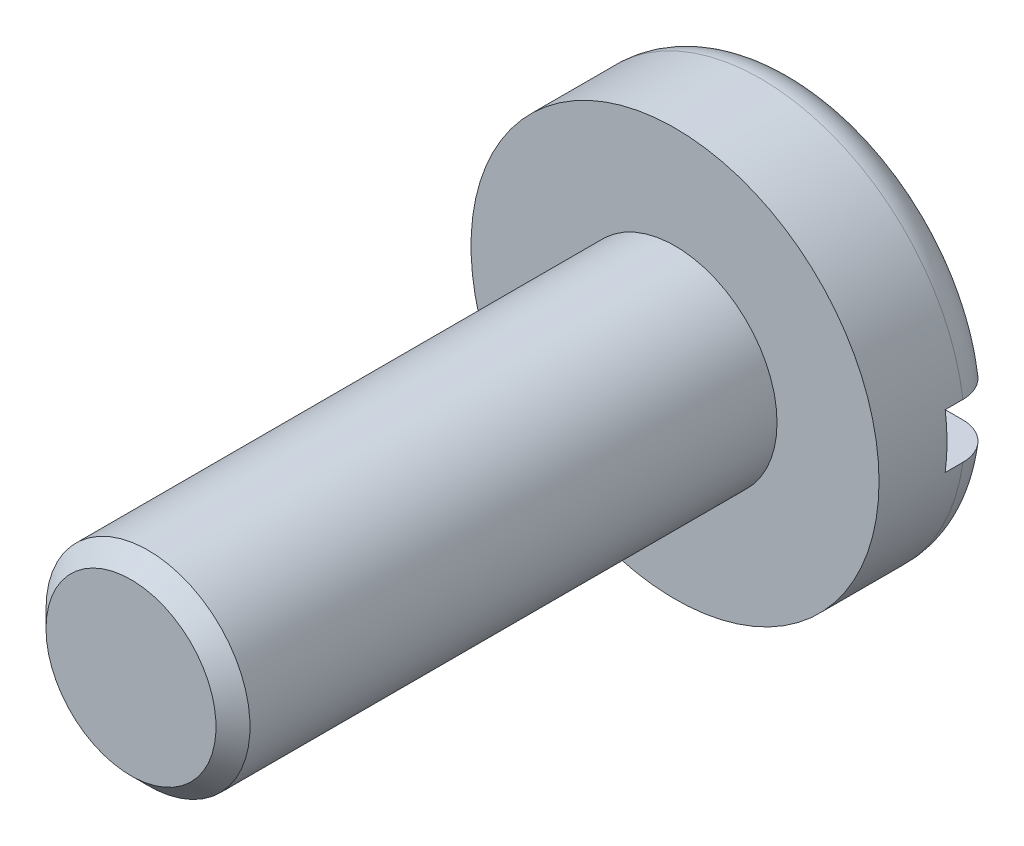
ISO-10303-21;
HEADER;
FILE_DESCRIPTION(('STEP AP214'),'2;1');
FILE_NAME('part.step','',(''),(''),'','','');
FILE_SCHEMA(('AUTOMOTIVE_DESIGN { 1 0 10303 214 1 1 1 1 }'));
ENDSEC;
DATA;
#1=APPLICATION_CONTEXT('core data for automotive mechanical design processes');
#2=APPLICATION_PROTOCOL_DEFINITION('international standard','automotive_design',2000,#1);
#3=PRODUCT_CONTEXT('',#1,'mechanical');
#4=PRODUCT('Part','Part','',(#3));
#5=PRODUCT_RELATED_PRODUCT_CATEGORY('part','',(#4));
#6=PRODUCT_DEFINITION_FORMATION('','',#4);
#7=PRODUCT_DEFINITION_CONTEXT('part definition',#1,'design');
#8=PRODUCT_DEFINITION('design','',#6,#7);
#9=PRODUCT_DEFINITION_SHAPE('','',#8);
#10=(LENGTH_UNIT() NAMED_UNIT(*) SI_UNIT(.MILLI.,.METRE.));
#11=(NAMED_UNIT(*) PLANE_ANGLE_UNIT() SI_UNIT($,.RADIAN.));
#12=(NAMED_UNIT(*) SI_UNIT($,.STERADIAN.) SOLID_ANGLE_UNIT());
#13=UNCERTAINTY_MEASURE_WITH_UNIT(LENGTH_MEASURE(1.E-05),#10,'distance_accuracy_value','');
#14=(GEOMETRIC_REPRESENTATION_CONTEXT(3) GLOBAL_UNCERTAINTY_ASSIGNED_CONTEXT((#13)) GLOBAL_UNIT_ASSIGNED_CONTEXT((#10,
#11,#12)) REPRESENTATION_CONTEXT('',''));
#15=CARTESIAN_POINT('',(0.,0.,0.));
#16=DIRECTION('',(0.,0.,1.));
#17=DIRECTION('',(1.,0.,0.));
#18=AXIS2_PLACEMENT_3D('',#15,#16,#17);
#19=CARTESIAN_POINT('',(0.,0.,3.6));
#20=DIRECTION('',(0.,0.,1.));
#21=DIRECTION('',(1.,0.,0.));
#22=AXIS2_PLACEMENT_3D('',#19,#20,#21);
#23=PLANE('',#22);
#24=CARTESIAN_POINT('',(0.,0.,3.6));
#25=DIRECTION('',(0.,0.,1.));
#26=DIRECTION('',(1.,0.,0.));
#27=AXIS2_PLACEMENT_3D('',#24,#25,#26);
#28=CIRCLE('',#27,6.);
#29=CARTESIAN_POINT('',(6.,0.,3.6));
#30=VERTEX_POINT('',#29);
#31=EDGE_CURVE('E150',#30,#30,#28,.T.);
#32=ORIENTED_EDGE('',*,*,#31,.T.);
#33=EDGE_LOOP('',(#32));
#34=FACE_BOUND('',#33,.T.);
#35=CARTESIAN_POINT('',(0.,0.,3.6));
#36=DIRECTION('',(0.,0.,1.));
#37=DIRECTION('',(1.,0.,0.));
#38=AXIS2_PLACEMENT_3D('',#35,#36,#37);
#39=CIRCLE('',#38,3.);
#40=CARTESIAN_POINT('',(3.,0.,3.6));
#41=VERTEX_POINT('',#40);
#42=EDGE_CURVE('E160',#41,#41,#39,.T.);
#43=ORIENTED_EDGE('',*,*,#42,.F.);
#44=EDGE_LOOP('',(#43));
#45=FACE_BOUND('',#44,.T.);
#46=ADVANCED_FACE('F33',(#34,#45),#23,.T.);
#47=CARTESIAN_POINT('',(0.,0.,0.));
#48=DIRECTION('',(0.,0.,1.));
#49=DIRECTION('',(1.,0.,0.));
#50=AXIS2_PLACEMENT_3D('',#47,#48,#49);
#51=PLANE('',#50);
#52=CARTESIAN_POINT('',(0.,0.,0.));
#53=DIRECTION('',(0.,0.,1.));
#54=DIRECTION('',(1.,0.,0.));
#55=AXIS2_PLACEMENT_3D('',#52,#53,#54);
#56=CIRCLE('',#55,4.92);
#57=CARTESIAN_POINT('',(-4.85452366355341,0.8,0.));
#58=VERTEX_POINT('',#57);
#59=CARTESIAN_POINT('',(4.85452366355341,0.8,0.));
#60=VERTEX_POINT('',#59);
#61=EDGE_CURVE('E107',#58,#60,#56,.F.);
#62=ORIENTED_EDGE('',*,*,#61,.T.);
#63=DIRECTION('',(1.,0.,0.));
#64=VECTOR('',#63,1.);
#65=CARTESIAN_POINT('',(-6.,0.800000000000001,0.));
#66=LINE('',#65,#64);
#67=EDGE_CURVE('E96',#58,#60,#66,.T.);
#68=ORIENTED_EDGE('',*,*,#67,.F.);
#69=EDGE_LOOP('',(#62,#68));
#70=FACE_BOUND('',#69,.T.);
#71=ADVANCED_FACE('F135',(#70),#51,.F.);
#72=CARTESIAN_POINT('',(0.,0.,1.08));
#73=DIRECTION('',(0.,0.,1.));
#74=DIRECTION('',(1.,0.,0.));
#75=AXIS2_PLACEMENT_3D('',#72,#73,#74);
#76=TOROIDAL_SURFACE('',#75,4.92,1.08);
#77=CARTESIAN_POINT('',(-5.60321799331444,0.8,0.293399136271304));
#78=CARTESIAN_POINT('',(-5.55825247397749,0.8,0.251523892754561));
#79=CARTESIAN_POINT('',(-5.50968619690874,0.8,0.213444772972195));
#80=CARTESIAN_POINT('',(-5.40679293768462,0.8,0.145975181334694));
#81=CARTESIAN_POINT('',(-5.35245837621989,0.800000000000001,0.116596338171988));
#82=CARTESIAN_POINT('',(-5.23968603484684,0.800000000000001,0.0673772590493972));
#83=CARTESIAN_POINT('',(-5.18125217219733,0.800000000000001,0.0475280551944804));
#84=CARTESIAN_POINT('',(-5.06191469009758,0.800000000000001,0.0178417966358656));
#85=CARTESIAN_POINT('',(-5.00101168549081,0.800000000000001,0.00800226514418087));
#86=CARTESIAN_POINT('',(-4.87792616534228,0.800000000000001,-0.00148497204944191));
#87=CARTESIAN_POINT('',(-4.81573730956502,0.800000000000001,-0.00105044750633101));
#88=CARTESIAN_POINT('',(-4.69229686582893,0.800000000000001,0.0101706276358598));
#89=CARTESIAN_POINT('',(-4.63104536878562,0.800000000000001,0.0209581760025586));
#90=CARTESIAN_POINT('',(-4.51074724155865,0.800000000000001,0.0526950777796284));
#91=CARTESIAN_POINT('',(-4.45172024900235,0.800000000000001,0.0737189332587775));
#92=CARTESIAN_POINT('',(-4.33803453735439,0.800000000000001,0.125385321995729));
#93=CARTESIAN_POINT('',(-4.28337589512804,0.8,0.15602802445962));
#94=CARTESIAN_POINT('',(-4.18006433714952,0.8,0.226070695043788));
#95=CARTESIAN_POINT('',(-4.13140566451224,0.8,0.265462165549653));
#96=CARTESIAN_POINT('',(-4.0414936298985,0.8,0.351948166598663));
#97=CARTESIAN_POINT('',(-4.0002398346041,0.8,0.399042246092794));
#98=CARTESIAN_POINT('',(-3.92689138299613,0.8,0.498992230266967));
#99=CARTESIAN_POINT('',(-3.89468909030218,0.8,0.551769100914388));
#100=CARTESIAN_POINT('',(-3.83980909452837,0.8,0.662062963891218));
#101=CARTESIAN_POINT('',(-3.81713019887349,0.8,0.719579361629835));
#102=CARTESIAN_POINT('',(-3.78240723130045,0.8,0.836503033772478));
#103=CARTESIAN_POINT('',(-3.77016237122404,0.8,0.895850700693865));
#104=CARTESIAN_POINT('',(-3.75597196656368,0.8,1.01576297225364));
#105=CARTESIAN_POINT('',(-3.75402537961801,0.8,1.07632745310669));
#106=CARTESIAN_POINT('',(-3.76044900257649,0.8,1.1960335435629));
#107=CARTESIAN_POINT('',(-3.76867210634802,0.8,1.25518311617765));
#108=CARTESIAN_POINT('',(-3.79491365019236,0.8,1.37126517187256));
#109=CARTESIAN_POINT('',(-3.81293207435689,0.8,1.42819765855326));
#110=CARTESIAN_POINT('',(-3.8582330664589,0.8,1.53838517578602));
#111=CARTESIAN_POINT('',(-3.88553516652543,0.8,1.59163216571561));
#112=CARTESIAN_POINT('',(-3.94855111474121,0.8,1.69288869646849));
#113=CARTESIAN_POINT('',(-3.98426562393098,0.8,1.74089782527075));
#114=CARTESIAN_POINT('',(-4.06371123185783,0.8,1.8311755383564));
#115=CARTESIAN_POINT('',(-4.10756531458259,0.8,1.87333586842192));
#116=CARTESIAN_POINT('',(-4.20161424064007,0.8,1.94986310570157));
#117=CARTESIAN_POINT('',(-4.25180971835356,0.8,1.98422923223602));
#118=CARTESIAN_POINT('',(-4.35814164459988,0.8,2.04485625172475));
#119=CARTESIAN_POINT('',(-4.4143723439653,0.8,2.07095191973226));
#120=CARTESIAN_POINT('',(-4.53038656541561,0.8,2.11344637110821));
#121=CARTESIAN_POINT('',(-4.5901703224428,0.8,2.1298445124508));
#122=CARTESIAN_POINT('',(-4.71227156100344,0.8,2.15261380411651));
#123=CARTESIAN_POINT('',(-4.77460906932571,0.8,2.15887775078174));
#124=CARTESIAN_POINT('',(-4.89945227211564,0.8,2.16084641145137));
#125=CARTESIAN_POINT('',(-4.96195796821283,0.8,2.1565510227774));
#126=CARTESIAN_POINT('',(-5.08531638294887,0.8,2.13748923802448));
#127=CARTESIAN_POINT('',(-5.14617006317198,0.8,2.12272907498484));
#128=CARTESIAN_POINT('',(-5.26450054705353,0.8,2.08311654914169));
#129=CARTESIAN_POINT('',(-5.32197747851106,0.8,2.05826456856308));
#130=CARTESIAN_POINT('',(-5.43140745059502,0.8,1.9993813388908));
#131=CARTESIAN_POINT('',(-5.48340223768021,0.8,1.96542769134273));
#132=CARTESIAN_POINT('',(-5.58087176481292,0.8,1.88918332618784));
#133=CARTESIAN_POINT('',(-5.62634686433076,0.8,1.84689306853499));
#134=CARTESIAN_POINT('',(-5.70896147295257,0.8,1.75567001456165));
#135=CARTESIAN_POINT('',(-5.74618611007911,0.8,1.70681430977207));
#136=CARTESIAN_POINT('',(-5.81181195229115,0.8,1.6034976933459));
#137=CARTESIAN_POINT('',(-5.84021361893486,0.8,1.549037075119));
#138=CARTESIAN_POINT('',(-5.88711486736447,0.8,1.43661179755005));
#139=CARTESIAN_POINT('',(-5.90570536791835,0.8,1.37868505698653));
#140=CARTESIAN_POINT('',(-5.93283351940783,0.8,1.26052624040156));
#141=CARTESIAN_POINT('',(-5.94137195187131,0.8,1.20029434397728));
#142=CARTESIAN_POINT('',(-5.94812248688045,0.8,1.07960971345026));
#143=CARTESIAN_POINT('',(-5.94639468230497,0.8,1.01916033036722));
#144=CARTESIAN_POINT('',(-5.93280159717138,0.8,0.899396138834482));
#145=CARTESIAN_POINT('',(-5.92093388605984,0.8,0.840081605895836));
#146=CARTESIAN_POINT('',(-5.88742368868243,0.8,0.724322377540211));
#147=CARTESIAN_POINT('',(-5.86578628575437,0.8,0.667876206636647));
#148=CARTESIAN_POINT('',(-5.81338741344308,0.8,0.559450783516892));
#149=CARTESIAN_POINT('',(-5.78263705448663,0.8,0.507466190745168));
#150=CARTESIAN_POINT('',(-5.72658123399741,0.8,0.428566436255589));
#151=CARTESIAN_POINT('',(-5.70384273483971,0.8,0.399792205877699));
#152=CARTESIAN_POINT('',(-5.65556901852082,0.8,0.344695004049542));
#153=CARTESIAN_POINT('',(-5.63003381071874,0.8,0.318372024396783));
#154=CARTESIAN_POINT('',(-5.60321799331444,0.8,0.293399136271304));
#155=B_SPLINE_CURVE_WITH_KNOTS('',3,(#77,#78,#79,#80,#81,#82,#83,#84,#85,#86,#87,#88,#89,#90,
#91,#92,#93,#94,#95,#96,#97,#98,#99,#100,#101,#102,#103,#104,#105,#106,#107,#108,#109,#110,#111,
#112,#113,#114,#115,#116,#117,#118,#119,#120,#121,#122,#123,#124,#125,#126,#127,#128,#129,#130,
#131,#132,#133,#134,#135,#136,#137,#138,#139,#140,#141,#142,#143,#144,#145,#146,#147,#148,#149,
#150,#151,#152,#153,#154),.UNSPECIFIED.,.T.,.F.,(4,2,2,2,2,2,2,2,2,2,2,2,2,2,2,2,2,2,2,2,2,2,2,
2,2,2,2,2,2,2,2,2,2,2,2,2,2,2,4),(0.,0.184198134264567,0.36864136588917,0.552910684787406,
0.737134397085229,0.922833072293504,1.10854964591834,1.29563858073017,1.48273080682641,
1.66964210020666,1.85654245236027,2.04111590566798,2.22566623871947,2.40657934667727,
2.58747414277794,2.76578260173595,2.94409077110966,3.12277643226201,3.30147613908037,
3.4831357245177,3.66481349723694,3.84992034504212,4.0350394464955,4.222104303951,
4.40917098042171,4.59612632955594,4.78307459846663,4.96847701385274,5.15386920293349,
5.33724886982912,5.52061894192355,5.70225850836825,5.8838839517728,6.06444731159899,
6.24505396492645,6.42556675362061,6.6058603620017,6.71570986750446,6.82555900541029),.UNSPECIFIED.);
#156=CARTESIAN_POINT('',(-5.94642749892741,0.8,1.08));
#157=VERTEX_POINT('',#156);
#158=EDGE_CURVE('E266',#157,#58,#155,.T.);
#159=ORIENTED_EDGE('',*,*,#158,.F.);
#160=CARTESIAN_POINT('',(0.,0.,1.08));
#161=DIRECTION('',(0.,0.,1.));
#162=DIRECTION('',(1.,0.,0.));
#163=AXIS2_PLACEMENT_3D('',#160,#161,#162);
#164=CIRCLE('',#163,6.);
#165=CARTESIAN_POINT('',(5.94642749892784,0.8,1.08000000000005));
#166=VERTEX_POINT('',#165);
#167=EDGE_CURVE('E111',#166,#157,#164,.T.);
#168=ORIENTED_EDGE('',*,*,#167,.F.);
#169=CARTESIAN_POINT('',(3.77369760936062,0.8,0.886020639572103));
#170=CARTESIAN_POINT('',(3.78475411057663,0.8,0.826796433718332));
#171=CARTESIAN_POINT('',(3.80088555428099,0.8,0.768471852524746));
#172=CARTESIAN_POINT('',(3.84278076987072,0.8,0.655335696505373));
#173=CARTESIAN_POINT('',(3.86855739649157,0.8,0.600528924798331));
#174=CARTESIAN_POINT('',(3.92887997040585,0.8,0.496066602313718));
#175=CARTESIAN_POINT('',(3.96341484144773,0.8,0.446404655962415));
#176=CARTESIAN_POINT('',(4.04021160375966,0.8,0.353494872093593));
#177=CARTESIAN_POINT('',(4.08247184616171,0.8,0.310245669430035));
#178=CARTESIAN_POINT('',(4.17414959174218,0.8,0.230702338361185));
#179=CARTESIAN_POINT('',(4.22365951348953,0.8,0.194514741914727));
#180=CARTESIAN_POINT('',(4.32797387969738,0.8,0.130803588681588));
#181=CARTESIAN_POINT('',(4.38277898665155,0.800000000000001,0.103281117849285));
#182=CARTESIAN_POINT('',(4.49709917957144,0.800000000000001,0.0572428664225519));
#183=CARTESIAN_POINT('',(4.55667673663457,0.800000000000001,0.0388820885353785));
#184=CARTESIAN_POINT('',(4.67806129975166,0.800000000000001,0.0123562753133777));
#185=CARTESIAN_POINT('',(4.73986840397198,0.800000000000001,0.00419168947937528));
#186=CARTESIAN_POINT('',(4.86434568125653,0.800000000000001,-0.0017142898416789));
#187=CARTESIAN_POINT('',(4.92701879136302,0.800000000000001,0.000605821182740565));
#188=CARTESIAN_POINT('',(5.0510778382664,0.800000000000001,0.0157813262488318));
#189=CARTESIAN_POINT('',(5.11246379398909,0.800000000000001,0.0286365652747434));
#190=CARTESIAN_POINT('',(5.23191371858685,0.800000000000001,0.0644845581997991));
#191=CARTESIAN_POINT('',(5.28999088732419,0.8,0.0874332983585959));
#192=CARTESIAN_POINT('',(5.40141187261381,0.8,0.1428508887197));
#193=CARTESIAN_POINT('',(5.45475591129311,0.8,0.175319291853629));
#194=CARTESIAN_POINT('',(5.55462759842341,0.8,0.24851499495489));
#195=CARTESIAN_POINT('',(5.60121753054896,0.8,0.289157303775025));
#196=CARTESIAN_POINT('',(5.68682103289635,0.8,0.377762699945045));
#197=CARTESIAN_POINT('',(5.72583504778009,0.8,0.425725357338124));
#198=CARTESIAN_POINT('',(5.79474249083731,0.8,0.527057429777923));
#199=CARTESIAN_POINT('',(5.82472877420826,0.8,0.580363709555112));
#200=CARTESIAN_POINT('',(5.87524139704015,0.8,0.69128442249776));
#201=CARTESIAN_POINT('',(5.89576819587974,0.8,0.748898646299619));
#202=CARTESIAN_POINT('',(5.92661791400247,0.8,0.866294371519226));
#203=CARTESIAN_POINT('',(5.9370225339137,0.8,0.926054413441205));
#204=CARTESIAN_POINT('',(5.94760793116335,0.8,1.04647268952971));
#205=CARTESIAN_POINT('',(5.94778899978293,0.8,1.10713089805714));
#206=CARTESIAN_POINT('',(5.93794172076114,0.8,1.22737445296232));
#207=CARTESIAN_POINT('',(5.92795298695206,0.8,1.28696304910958));
#208=CARTESIAN_POINT('',(5.89812240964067,0.8,1.40361955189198));
#209=CARTESIAN_POINT('',(5.87828060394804,0.8,1.46068746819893));
#210=CARTESIAN_POINT('',(5.82930347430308,0.8,1.57075209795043));
#211=CARTESIAN_POINT('',(5.80015888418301,0.8,1.62374468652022));
#212=CARTESIAN_POINT('',(5.73343417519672,0.8,1.72412061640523));
#213=CARTESIAN_POINT('',(5.69585388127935,0.8,1.77150384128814));
#214=CARTESIAN_POINT('',(5.61310756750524,0.8,1.85961420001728));
#215=CARTESIAN_POINT('',(5.56789968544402,0.8,1.90030201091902));
#216=CARTESIAN_POINT('',(5.47134897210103,0.8,1.97359339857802));
#217=CARTESIAN_POINT('',(5.42000587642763,0.8,2.00619662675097));
#218=CARTESIAN_POINT('',(5.31213468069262,0.8,2.06272418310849));
#219=CARTESIAN_POINT('',(5.2555627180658,0.8,2.0865647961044));
#220=CARTESIAN_POINT('',(5.13924688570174,0.8,2.12452354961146));
#221=CARTESIAN_POINT('',(5.07950283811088,0.8,2.13864114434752));
#222=CARTESIAN_POINT('',(4.95785084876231,0.8,2.15690896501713));
#223=CARTESIAN_POINT('',(4.89592652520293,0.8,2.16095012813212));
#224=CARTESIAN_POINT('',(4.77226783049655,0.8,2.15867376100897));
#225=CARTESIAN_POINT('',(4.71053347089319,0.8,2.15235561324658));
#226=CARTESIAN_POINT('',(4.58845184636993,0.8,2.12945629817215));
#227=CARTESIAN_POINT('',(4.52812087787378,0.8,2.11278816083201));
#228=CARTESIAN_POINT('',(4.41110370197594,0.8,2.06957467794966));
#229=CARTESIAN_POINT('',(4.35441760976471,0.8,2.04302902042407));
#230=CARTESIAN_POINT('',(4.24624809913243,0.8,1.98073829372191));
#231=CARTESIAN_POINT('',(4.19477134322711,0.8,1.94498164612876));
#232=CARTESIAN_POINT('',(4.09862763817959,0.8,1.86525470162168));
#233=CARTESIAN_POINT('',(4.05396016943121,0.8,1.82128503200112));
#234=CARTESIAN_POINT('',(3.97321865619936,0.8,1.72682641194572));
#235=CARTESIAN_POINT('',(3.93706233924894,0.8,1.67640782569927));
#236=CARTESIAN_POINT('',(3.87391069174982,0.8,1.57010629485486));
#237=CARTESIAN_POINT('',(3.84691665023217,0.8,1.51422258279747));
#238=CARTESIAN_POINT('',(3.80340786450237,0.8,1.39970451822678));
#239=CARTESIAN_POINT('',(3.78670841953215,0.8,1.34114021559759));
#240=CARTESIAN_POINT('',(3.76359114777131,0.8,1.22206993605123));
#241=CARTESIAN_POINT('',(3.75715917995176,0.8,1.16156674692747));
#242=CARTESIAN_POINT('',(3.75523270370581,0.8,1.06498850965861));
#243=CARTESIAN_POINT('',(3.7563624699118,0.8,1.02894864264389));
#244=CARTESIAN_POINT('',(3.76228916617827,0.8,0.957172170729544));
#245=CARTESIAN_POINT('',(3.76708603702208,0.8,0.921435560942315));
#246=CARTESIAN_POINT('',(3.77369760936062,0.8,0.886020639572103));
#247=B_SPLINE_CURVE_WITH_KNOTS('',3,(#169,#170,#171,#172,#173,#174,#175,#176,#177,#178,#179,
#180,#181,#182,#183,#184,#185,#186,#187,#188,#189,#190,#191,#192,#193,#194,#195,#196,#197,#198,
#199,#200,#201,#202,#203,#204,#205,#206,#207,#208,#209,#210,#211,#212,#213,#214,#215,#216,#217,
#218,#219,#220,#221,#222,#223,#224,#225,#226,#227,#228,#229,#230,#231,#232,#233,#234,#235,#236,
#237,#238,#239,#240,#241,#242,#243,#244,#245,#246),.UNSPECIFIED.,.T.,.F.,(4,2,2,2,2,2,2,2,2,2,2,
2,2,2,2,2,2,2,2,2,2,2,2,2,2,2,2,2,2,2,2,2,2,2,2,2,2,2,4),(0.,0.180607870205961,0.36145731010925,
0.542079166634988,0.722662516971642,0.905789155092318,1.08893873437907,1.27508994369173,
1.46124935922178,1.64850222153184,1.83575232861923,2.02219388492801,2.20862668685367,
2.39321284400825,2.57778816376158,2.76039450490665,2.9429919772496,3.12410308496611,
3.30520903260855,3.48561221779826,3.66601471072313,3.84659745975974,4.02718395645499,
4.2087958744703,4.39041562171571,4.57372798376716,4.75705063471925,4.94234903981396,
5.12765849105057,5.31454655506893,5.50144052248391,5.68857057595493,5.8756863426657,
6.0609113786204,6.24616246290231,6.42798498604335,6.60955687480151,6.71755860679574,
6.82555859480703),.UNSPECIFIED.);
#248=EDGE_CURVE('E104',#60,#166,#247,.T.);
#249=ORIENTED_EDGE('',*,*,#248,.F.);
#250=ORIENTED_EDGE('',*,*,#61,.F.);
#251=EDGE_LOOP('',(#159,#168,#249,#250));
#252=FACE_BOUND('',#251,.T.);
#253=ADVANCED_FACE('F140',(#252),#76,.T.);
#254=CARTESIAN_POINT('',(0.,0.,3.6));
#255=DIRECTION('',(0.,0.,-1.));
#256=DIRECTION('',(-1.,0.,0.));
#257=AXIS2_PLACEMENT_3D('',#254,#255,#256);
#258=CYLINDRICAL_SURFACE('',#257,6.);
#259=DIRECTION('',(0.,0.,-1.));
#260=VECTOR('',#259,1.);
#261=CARTESIAN_POINT('',(-5.9464274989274,0.799999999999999,3.6));
#262=LINE('',#261,#260);
#263=CARTESIAN_POINT('',(-5.9464274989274,0.8,1.6));
#264=VERTEX_POINT('',#263);
#265=EDGE_CURVE('E57',#157,#264,#262,.F.);
#266=ORIENTED_EDGE('',*,*,#265,.T.);
#267=CARTESIAN_POINT('',(0.,0.,1.6));
#268=DIRECTION('',(0.,0.,1.));
#269=DIRECTION('',(0.,-1.,0.));
#270=AXIS2_PLACEMENT_3D('',#267,#268,#269);
#271=CIRCLE('',#270,6.);
#272=CARTESIAN_POINT('',(-5.9464274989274,-0.8,1.6));
#273=VERTEX_POINT('',#272);
#274=EDGE_CURVE('E12',#264,#273,#271,.T.);
#275=ORIENTED_EDGE('',*,*,#274,.T.);
#276=DIRECTION('',(0.,0.,-1.));
#277=VECTOR('',#276,1.);
#278=CARTESIAN_POINT('',(-5.9464274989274,-0.8,3.6));
#279=LINE('',#278,#277);
#280=CARTESIAN_POINT('',(-5.9464274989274,-0.8,1.08));
#281=VERTEX_POINT('',#280);
#282=EDGE_CURVE('E156',#273,#281,#279,.T.);
#283=ORIENTED_EDGE('',*,*,#282,.T.);
#284=CARTESIAN_POINT('',(5.9464274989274,-0.8,1.08));
#285=VERTEX_POINT('',#284);
#286=EDGE_CURVE('E103',#281,#285,#164,.T.);
#287=ORIENTED_EDGE('',*,*,#286,.T.);
#288=DIRECTION('',(0.,0.,-1.));
#289=VECTOR('',#288,1.);
#290=CARTESIAN_POINT('',(5.9464274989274,-0.8,3.6));
#291=LINE('',#290,#289);
#292=CARTESIAN_POINT('',(5.9464274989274,-0.8,1.6));
#293=VERTEX_POINT('',#292);
#294=EDGE_CURVE('E49',#285,#293,#291,.F.);
#295=ORIENTED_EDGE('',*,*,#294,.T.);
#296=CARTESIAN_POINT('',(5.9464274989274,0.8,1.6));
#297=VERTEX_POINT('',#296);
#298=EDGE_CURVE('E38',#293,#297,#271,.T.);
#299=ORIENTED_EDGE('',*,*,#298,.T.);
#300=DIRECTION('',(0.,0.,-1.));
#301=VECTOR('',#300,1.);
#302=CARTESIAN_POINT('',(5.9464274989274,0.799999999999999,3.6));
#303=LINE('',#302,#301);
#304=EDGE_CURVE('E151',#297,#166,#303,.T.);
#305=ORIENTED_EDGE('',*,*,#304,.T.);
#306=ORIENTED_EDGE('',*,*,#167,.T.);
#307=EDGE_LOOP('',(#266,#275,#283,#287,#295,#299,#305,#306));
#308=FACE_BOUND('',#307,.T.);
#309=ORIENTED_EDGE('',*,*,#31,.F.);
#310=EDGE_LOOP('',(#309));
#311=FACE_BOUND('',#310,.T.);
#312=ADVANCED_FACE('F138',(#308,#311),#258,.T.);
#313=CARTESIAN_POINT('',(4.8545236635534,-0.8,0.));
#314=VERTEX_POINT('',#313);
#315=CARTESIAN_POINT('',(-4.85452366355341,-0.8,0.));
#316=VERTEX_POINT('',#315);
#317=EDGE_CURVE('E101',#314,#316,#56,.F.);
#318=ORIENTED_EDGE('',*,*,#317,.T.);
#319=DIRECTION('',(1.,0.,0.));
#320=VECTOR('',#319,1.);
#321=CARTESIAN_POINT('',(-6.,-0.8,0.));
#322=LINE('',#321,#320);
#323=EDGE_CURVE('E87',#316,#314,#322,.T.);
#324=ORIENTED_EDGE('',*,*,#323,.T.);
#325=EDGE_LOOP('',(#318,#324));
#326=FACE_BOUND('',#325,.T.);
#327=ADVANCED_FACE('F106',(#326),#51,.F.);
#328=CARTESIAN_POINT('',(-5.60321799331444,-0.8,0.293399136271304));
#329=CARTESIAN_POINT('',(-5.64752534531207,-0.8,0.334668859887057));
#330=CARTESIAN_POINT('',(-5.68840038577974,-0.8,0.379684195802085));
#331=CARTESIAN_POINT('',(-5.76205941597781,-0.8,0.475965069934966));
#332=CARTESIAN_POINT('',(-5.79483455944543,-0.8,0.527237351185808));
#333=CARTESIAN_POINT('',(-5.85128716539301,-0.8,0.634564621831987));
#334=CARTESIAN_POINT('',(-5.87496603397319,-0.8,0.690618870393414));
#335=CARTESIAN_POINT('',(-5.9125179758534,-0.8,0.805906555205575));
#336=CARTESIAN_POINT('',(-5.92639337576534,-0.8,0.865139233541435));
#337=CARTESIAN_POINT('',(-5.94389194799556,-0.8,0.98481470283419));
#338=CARTESIAN_POINT('',(-5.94756311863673,-0.8,1.04525047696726));
#339=CARTESIAN_POINT('',(-5.94468119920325,-0.8,1.16587891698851));
#340=CARTESIAN_POINT('',(-5.93812795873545,-0.8,1.22607157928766));
#341=CARTESIAN_POINT('',(-5.91501896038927,-0.8,1.34435943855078));
#342=CARTESIAN_POINT('',(-5.898486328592,-0.8,1.40245915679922));
#343=CARTESIAN_POINT('',(-5.85592607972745,-0.8,1.51506855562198));
#344=CARTESIAN_POINT('',(-5.82989843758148,-0.8,1.56957822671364));
#345=CARTESIAN_POINT('',(-5.76903031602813,-0.8,1.67362171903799));
#346=CARTESIAN_POINT('',(-5.73416707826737,-0.8,1.72314222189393));
#347=CARTESIAN_POINT('',(-5.65667542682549,-0.8,1.81567843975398));
#348=CARTESIAN_POINT('',(-5.61404680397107,-0.8,1.85869397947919));
#349=CARTESIAN_POINT('',(-5.52192227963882,-0.8,1.93733298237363));
#350=CARTESIAN_POINT('',(-5.47238014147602,-0.8,1.97290226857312));
#351=CARTESIAN_POINT('',(-5.36807612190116,-0.8,2.03531519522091));
#352=CARTESIAN_POINT('',(-5.31331398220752,-0.8,2.06215840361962));
#353=CARTESIAN_POINT('',(-5.19953486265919,-0.8,2.10664997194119));
#354=CARTESIAN_POINT('',(-5.14048046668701,-0.8,2.12420263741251));
#355=CARTESIAN_POINT('',(-5.02027740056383,-0.8,2.14925862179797));
#356=CARTESIAN_POINT('',(-4.95912860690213,-0.8,2.15676134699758));
#357=CARTESIAN_POINT('',(-4.8357856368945,-0.8,2.16157610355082));
#358=CARTESIAN_POINT('',(-4.7735872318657,-0.8,2.1587800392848));
#359=CARTESIAN_POINT('',(-4.65052526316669,-0.8,2.14285994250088));
#360=CARTESIAN_POINT('',(-4.5896617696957,-0.8,2.12973536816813));
#361=CARTESIAN_POINT('',(-4.47057295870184,-0.8,2.09340454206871));
#362=CARTESIAN_POINT('',(-4.41236806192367,-0.8,2.07013129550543));
#363=CARTESIAN_POINT('',(-4.30069974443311,-0.8,2.01412425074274));
#364=CARTESIAN_POINT('',(-4.24723638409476,-0.8,1.98139033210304));
#365=CARTESIAN_POINT('',(-4.14672619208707,-0.8,1.90742859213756));
#366=CARTESIAN_POINT('',(-4.09966548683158,-0.8,1.86621963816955));
#367=CARTESIAN_POINT('',(-4.01324642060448,-0.8,1.77638781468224));
#368=CARTESIAN_POINT('',(-3.97388754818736,-0.8,1.72776543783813));
#369=CARTESIAN_POINT('',(-3.90459607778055,-0.8,1.62517882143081));
#370=CARTESIAN_POINT('',(-3.87454196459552,-0.8,1.57129670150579));
#371=CARTESIAN_POINT('',(-3.82411806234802,-0.8,1.45917672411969));
#372=CARTESIAN_POINT('',(-3.80374701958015,-0.8,1.40093943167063));
#373=CARTESIAN_POINT('',(-3.77368039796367,-0.8,1.28300265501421));
#374=CARTESIAN_POINT('',(-3.76378114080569,-0.8,1.22335506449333));
#375=CARTESIAN_POINT('',(-3.75428229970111,-0.8,1.10324733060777));
#376=CARTESIAN_POINT('',(-3.75468177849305,-0.8,1.0427872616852));
#377=CARTESIAN_POINT('',(-3.76569312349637,-0.8,0.92359048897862));
#378=CARTESIAN_POINT('',(-3.77617411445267,-0.8,0.864841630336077));
#379=CARTESIAN_POINT('',(-3.80681186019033,-0.8,0.749926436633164));
#380=CARTESIAN_POINT('',(-3.82696869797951,-0.8,0.693760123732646));
#381=CARTESIAN_POINT('',(-3.87641911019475,-0.8,0.585329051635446));
#382=CARTESIAN_POINT('',(-3.90575008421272,-0.8,0.533081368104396));
#383=CARTESIAN_POINT('',(-3.97262318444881,-0.8,0.434137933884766));
#384=CARTESIAN_POINT('',(-4.01016601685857,-0.8,0.387442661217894));
#385=CARTESIAN_POINT('',(-4.0930908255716,-0.8,0.300050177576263));
#386=CARTESIAN_POINT('',(-4.13859855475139,-0.8,0.259472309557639));
#387=CARTESIAN_POINT('',(-4.23567492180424,-0.8,0.186365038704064));
#388=CARTESIAN_POINT('',(-4.28724416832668,-0.8,0.153836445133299));
#389=CARTESIAN_POINT('',(-4.39600429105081,-0.8,0.0971465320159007));
#390=CARTESIAN_POINT('',(-4.45328097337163,-0.8,0.0731497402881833));
#391=CARTESIAN_POINT('',(-4.57102539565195,-0.8,0.0350120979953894));
#392=CARTESIAN_POINT('',(-4.63149320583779,-0.8,0.0208714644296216));
#393=CARTESIAN_POINT('',(-4.75450006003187,-0.8,0.00275589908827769));
#394=CARTESIAN_POINT('',(-4.81705297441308,-0.8,-0.00112503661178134));
#395=CARTESIAN_POINT('',(-4.9419391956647,-0.8,0.00168734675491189));
#396=CARTESIAN_POINT('',(-5.00427244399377,-0.8,0.00838329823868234));
#397=CARTESIAN_POINT('',(-5.12683509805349,-0.8,0.0321866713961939));
#398=CARTESIAN_POINT('',(-5.18706700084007,-0.8,0.0492812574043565));
#399=CARTESIAN_POINT('',(-5.30371067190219,-0.8,0.0934235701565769));
#400=CARTESIAN_POINT('',(-5.36012708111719,-0.8,0.12045893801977));
#401=CARTESIAN_POINT('',(-5.44781145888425,-0.8,0.172108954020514));
#402=CARTESIAN_POINT('',(-5.48072351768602,-0.8,0.193984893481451));
#403=CARTESIAN_POINT('',(-5.54398272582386,-0.8,0.241176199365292));
#404=CARTESIAN_POINT('',(-5.57432988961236,-0.8,0.266491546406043));
#405=CARTESIAN_POINT('',(-5.60321799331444,-0.8,0.293399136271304));
#406=B_SPLINE_CURVE_WITH_KNOTS('',3,(#328,#329,#330,#331,#332,#333,#334,#335,#336,#337,#338,
#339,#340,#341,#342,#343,#344,#345,#346,#347,#348,#349,#350,#351,#352,#353,#354,#355,#356,#357,
#358,#359,#360,#361,#362,#363,#364,#365,#366,#367,#368,#369,#370,#371,#372,#373,#374,#375,#376,
#377,#378,#379,#380,#381,#382,#383,#384,#385,#386,#387,#388,#389,#390,#391,#392,#393,#394,#395,
#396,#397,#398,#399,#400,#401,#402,#403,#404,#405),.UNSPECIFIED.,.T.,.F.,(4,2,2,2,2,2,2,2,2,2,2,
2,2,2,2,2,2,2,2,2,2,2,2,2,2,2,2,2,2,2,2,2,2,2,2,2,2,2,4),(0.,0.18150813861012,0.363213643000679,
0.54489104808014,0.726525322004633,0.907303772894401,1.08808488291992,1.2684486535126,
1.44881290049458,1.62964652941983,1.81048503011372,1.99259674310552,2.17471747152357,
2.35867926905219,2.54265193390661,2.72856104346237,2.91447990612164,3.10164511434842,
3.28881270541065,3.47556804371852,3.66231097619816,3.84650084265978,4.03066685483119,
4.2111809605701,4.39167863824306,4.56986433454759,4.74805155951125,4.92697487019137,
5.10591357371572,5.28798549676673,5.47007571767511,5.65550796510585,5.84094429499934,
6.02807373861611,6.21524976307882,6.40219521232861,6.58890902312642,6.70725180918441,
6.82559392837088),.UNSPECIFIED.);
#407=EDGE_CURVE('E90',#316,#281,#406,.T.);
#408=ORIENTED_EDGE('',*,*,#407,.F.);
#409=ORIENTED_EDGE('',*,*,#317,.F.);
#410=CARTESIAN_POINT('',(3.77369760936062,-0.8,0.886020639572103));
#411=CARTESIAN_POINT('',(3.76278738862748,-0.8,0.944492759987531));
#412=CARTESIAN_POINT('',(3.75680744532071,-0.8,1.00392722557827));
#413=CARTESIAN_POINT('',(3.7549359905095,-0.8,1.12299957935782));
#414=CARTESIAN_POINT('',(3.75905556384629,-0.8,1.18263761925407));
#415=CARTESIAN_POINT('',(3.7772547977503,-0.8,1.30033630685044));
#416=CARTESIAN_POINT('',(3.79132782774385,-0.8,1.35839797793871));
#417=CARTESIAN_POINT('',(3.82896534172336,-0.8,1.47134031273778));
#418=CARTESIAN_POINT('',(3.85252809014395,-0.8,1.52622155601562));
#419=CARTESIAN_POINT('',(3.90856556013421,-0.8,1.63162828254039));
#420=CARTESIAN_POINT('',(3.94109057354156,-0.8,1.68212700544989));
#421=CARTESIAN_POINT('',(4.0140113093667,-0.8,1.77707981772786));
#422=CARTESIAN_POINT('',(4.05440795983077,-0.8,1.82153319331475));
#423=CARTESIAN_POINT('',(4.14272839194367,-0.8,1.90401709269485));
#424=CARTESIAN_POINT('',(4.19077859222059,-0.8,1.94191224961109));
#425=CARTESIAN_POINT('',(4.29246926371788,-0.8,2.00926174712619));
#426=CARTESIAN_POINT('',(4.34611026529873,-0.8,2.03871528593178));
#427=CARTESIAN_POINT('',(4.45845872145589,-0.8,2.08884798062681));
#428=CARTESIAN_POINT('',(4.51723742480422,-0.8,2.10936757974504));
#429=CARTESIAN_POINT('',(4.63739300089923,-0.8,2.14032784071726));
#430=CARTESIAN_POINT('',(4.69876999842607,-0.8,2.1507680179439));
#431=CARTESIAN_POINT('',(4.82285050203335,-0.8,2.16130492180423));
#432=CARTESIAN_POINT('',(4.88556035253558,-0.8,2.16132721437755));
#433=CARTESIAN_POINT('',(5.01008937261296,-0.8,2.15080736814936));
#434=CARTESIAN_POINT('',(5.07190854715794,-0.8,2.14026528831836));
#435=CARTESIAN_POINT('',(5.19266904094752,-0.8,2.10892474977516));
#436=CARTESIAN_POINT('',(5.25161938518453,-0.8,2.08816109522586));
#437=CARTESIAN_POINT('',(5.36514675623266,-0.8,2.03693761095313));
#438=CARTESIAN_POINT('',(5.41972398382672,-0.8,2.00647822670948));
#439=CARTESIAN_POINT('',(5.52239408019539,-0.8,1.93703246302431));
#440=CARTESIAN_POINT('',(5.57054386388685,-0.8,1.89813023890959));
#441=CARTESIAN_POINT('',(5.65953908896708,-0.8,1.81271408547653));
#442=CARTESIAN_POINT('',(5.70038495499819,-0.8,1.76620059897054));
#443=CARTESIAN_POINT('',(5.77314909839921,-0.8,1.66742331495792));
#444=CARTESIAN_POINT('',(5.8051588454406,-0.8,1.61522689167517));
#445=CARTESIAN_POINT('',(5.85987317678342,-0.8,1.50616556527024));
#446=CARTESIAN_POINT('',(5.88257823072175,-0.8,1.44930089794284));
#447=CARTESIAN_POINT('',(5.91784827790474,-0.8,1.33304035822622));
#448=CARTESIAN_POINT('',(5.93049810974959,-0.8,1.27367021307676));
#449=CARTESIAN_POINT('',(5.94560189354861,-0.8,1.15364732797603));
#450=CARTESIAN_POINT('',(5.94805616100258,-0.8,1.09299462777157));
#451=CARTESIAN_POINT('',(5.94270790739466,-0.8,0.972411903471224));
#452=CARTESIAN_POINT('',(5.93495045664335,-0.8,0.912479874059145));
#453=CARTESIAN_POINT('',(5.90948759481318,-0.8,0.794768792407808));
#454=CARTESIAN_POINT('',(5.89178225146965,-0.8,0.736989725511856));
#455=CARTESIAN_POINT('',(5.84693566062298,-0.8,0.625188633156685));
#456=CARTESIAN_POINT('',(5.81979012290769,-0.8,0.571168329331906));
#457=CARTESIAN_POINT('',(5.7568596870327,-0.8,0.468420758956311));
#458=CARTESIAN_POINT('',(5.72107462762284,-0.8,0.419693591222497));
#459=CARTESIAN_POINT('',(5.64169418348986,-0.8,0.328634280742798));
#460=CARTESIAN_POINT('',(5.59805918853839,-0.8,0.286336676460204));
#461=CARTESIAN_POINT('',(5.50436276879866,-0.8,0.209589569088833));
#462=CARTESIAN_POINT('',(5.45430109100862,-0.8,0.17514037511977));
#463=CARTESIAN_POINT('',(5.34869546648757,-0.8,0.114729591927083));
#464=CARTESIAN_POINT('',(5.29310624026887,-0.8,0.0888471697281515));
#465=CARTESIAN_POINT('',(5.17840312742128,-0.8,0.0466702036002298));
#466=CARTESIAN_POINT('',(5.11928903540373,-0.8,0.0303762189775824));
#467=CARTESIAN_POINT('',(4.9985344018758,-0.8,0.00765619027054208));
#468=CARTESIAN_POINT('',(4.93687351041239,-0.8,0.00133828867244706));
#469=CARTESIAN_POINT('',(4.81335916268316,-0.8,-0.000955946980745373));
#470=CARTESIAN_POINT('',(4.75150569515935,-0.8,0.00306833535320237));
#471=CARTESIAN_POINT('',(4.62877110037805,-0.8,0.0214070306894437));
#472=CARTESIAN_POINT('',(4.56790377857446,-0.8,0.0358139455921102));
#473=CARTESIAN_POINT('',(4.44944046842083,-0.8,0.0746155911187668));
#474=CARTESIAN_POINT('',(4.39184447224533,-0.8,0.09901029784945));
#475=CARTESIAN_POINT('',(4.28144353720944,-0.8,0.157190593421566));
#476=CARTESIAN_POINT('',(4.22864938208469,-0.8,0.190996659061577));
#477=CARTESIAN_POINT('',(4.12953305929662,-0.8,0.267074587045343));
#478=CARTESIAN_POINT('',(4.08321233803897,-0.8,0.309348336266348));
#479=CARTESIAN_POINT('',(3.99882302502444,-0.8,0.400808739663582));
#480=CARTESIAN_POINT('',(3.96068981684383,-0.8,0.449935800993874));
#481=CARTESIAN_POINT('',(3.89343644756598,-0.8,0.553956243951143));
#482=CARTESIAN_POINT('',(3.86430417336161,-0.8,0.60884174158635));
#483=CARTESIAN_POINT('',(3.82513624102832,-0.8,0.701161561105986));
#484=CARTESIAN_POINT('',(3.81204692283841,-0.8,0.737331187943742));
#485=CARTESIAN_POINT('',(3.78985175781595,-0.8,0.810873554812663));
#486=CARTESIAN_POINT('',(3.78074586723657,-0.8,0.848246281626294));
#487=CARTESIAN_POINT('',(3.77369760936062,-0.8,0.886020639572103));
#488=B_SPLINE_CURVE_WITH_KNOTS('',3,(#410,#411,#412,#413,#414,#415,#416,#417,#418,#419,#420,
#421,#422,#423,#424,#425,#426,#427,#428,#429,#430,#431,#432,#433,#434,#435,#436,#437,#438,#439,
#440,#441,#442,#443,#444,#445,#446,#447,#448,#449,#450,#451,#452,#453,#454,#455,#456,#457,#458,
#459,#460,#461,#462,#463,#464,#465,#466,#467,#468,#469,#470,#471,#472,#473,#474,#475,#476,#477,
#478,#479,#480,#481,#482,#483,#484,#485,#486,#487),.UNSPECIFIED.,.T.,.F.,(4,2,2,2,2,2,2,2,2,2,2,
2,2,2,2,2,2,2,2,2,2,2,2,2,2,2,2,2,2,2,2,2,2,2,2,2,2,2,4),(0.,0.178303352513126,
0.356802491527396,0.535182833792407,0.713530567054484,0.892900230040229,1.07229105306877,
1.2550301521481,1.43778660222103,1.62368504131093,1.80959241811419,1.99682805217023,
2.18406264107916,2.37066406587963,2.55725691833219,2.74206894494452,2.92687022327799,
3.10967987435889,3.29248029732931,3.47372150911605,3.65495711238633,3.83539549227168,
4.01583264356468,4.1963519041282,4.37687453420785,4.55833501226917,4.73980263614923,
4.92290323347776,5.10601451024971,5.29109744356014,5.47619140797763,5.66295514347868,
5.84971843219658,6.03689129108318,6.22410590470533,6.40978377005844,6.59521065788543,
6.71040006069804,6.82558819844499),.UNSPECIFIED.);
#489=EDGE_CURVE('E92',#285,#314,#488,.T.);
#490=ORIENTED_EDGE('',*,*,#489,.F.);
#491=ORIENTED_EDGE('',*,*,#286,.F.);
#492=EDGE_LOOP('',(#408,#409,#490,#491));
#493=FACE_BOUND('',#492,.T.);
#494=ADVANCED_FACE('F35',(#493),#76,.T.);
#495=CARTESIAN_POINT('',(-6.,0.8,1.6));
#496=DIRECTION('',(0.,0.,1.));
#497=DIRECTION('',(0.,-1.,0.));
#498=AXIS2_PLACEMENT_3D('',#495,#496,#497);
#499=PLANE('',#498);
#500=DIRECTION('',(1.,0.,0.));
#501=VECTOR('',#500,1.);
#502=CARTESIAN_POINT('',(-6.,-0.8,1.6));
#503=LINE('',#502,#501);
#504=EDGE_CURVE('E97',#273,#293,#503,.T.);
#505=ORIENTED_EDGE('',*,*,#504,.F.);
#506=ORIENTED_EDGE('',*,*,#274,.F.);
#507=DIRECTION('',(1.,0.,0.));
#508=VECTOR('',#507,1.);
#509=CARTESIAN_POINT('',(-6.,0.8,1.6));
#510=LINE('',#509,#508);
#511=EDGE_CURVE('E159',#264,#297,#510,.T.);
#512=ORIENTED_EDGE('',*,*,#511,.T.);
#513=ORIENTED_EDGE('',*,*,#298,.F.);
#514=EDGE_LOOP('',(#505,#506,#512,#513));
#515=FACE_BOUND('',#514,.T.);
#516=ADVANCED_FACE('F128',(#515),#499,.F.);
#517=CARTESIAN_POINT('',(-6.,0.8,1.6));
#518=DIRECTION('',(0.,1.,0.));
#519=DIRECTION('',(0.,0.,1.));
#520=AXIS2_PLACEMENT_3D('',#517,#518,#519);
#521=PLANE('',#520);
#522=ORIENTED_EDGE('',*,*,#158,.T.);
#523=ORIENTED_EDGE('',*,*,#67,.T.);
#524=ORIENTED_EDGE('',*,*,#248,.T.);
#525=ORIENTED_EDGE('',*,*,#304,.F.);
#526=ORIENTED_EDGE('',*,*,#511,.F.);
#527=ORIENTED_EDGE('',*,*,#265,.F.);
#528=EDGE_LOOP('',(#522,#523,#524,#525,#526,#527));
#529=FACE_BOUND('',#528,.T.);
#530=ADVANCED_FACE('F125',(#529),#521,.F.);
#531=CARTESIAN_POINT('',(-6.,-0.8,1.6));
#532=DIRECTION('',(0.,-1.,0.));
#533=DIRECTION('',(0.,0.,-1.));
#534=AXIS2_PLACEMENT_3D('',#531,#532,#533);
#535=PLANE('',#534);
#536=ORIENTED_EDGE('',*,*,#504,.T.);
#537=ORIENTED_EDGE('',*,*,#294,.F.);
#538=ORIENTED_EDGE('',*,*,#489,.T.);
#539=ORIENTED_EDGE('',*,*,#323,.F.);
#540=ORIENTED_EDGE('',*,*,#407,.T.);
#541=ORIENTED_EDGE('',*,*,#282,.F.);
#542=EDGE_LOOP('',(#536,#537,#538,#539,#540,#541));
#543=FACE_BOUND('',#542,.T.);
#544=ADVANCED_FACE('F89',(#543),#535,.F.);
#545=CARTESIAN_POINT('',(0.,0.,19.6));
#546=DIRECTION('',(0.,0.,-1.));
#547=DIRECTION('',(-1.,0.,0.));
#548=AXIS2_PLACEMENT_3D('',#545,#546,#547);
#549=CYLINDRICAL_SURFACE('',#548,3.);
#550=CARTESIAN_POINT('',(0.,0.,19.1));
#551=DIRECTION('',(0.,0.,-1.));
#552=DIRECTION('',(-1.,0.,0.));
#553=AXIS2_PLACEMENT_3D('',#550,#551,#552);
#554=CIRCLE('',#553,3.);
#555=CARTESIAN_POINT('',(-3.,0.,19.1));
#556=VERTEX_POINT('',#555);
#557=EDGE_CURVE('E170',#556,#556,#554,.T.);
#558=ORIENTED_EDGE('',*,*,#557,.T.);
#559=EDGE_LOOP('',(#558));
#560=FACE_BOUND('',#559,.T.);
#561=ORIENTED_EDGE('',*,*,#42,.T.);
#562=EDGE_LOOP('',(#561));
#563=FACE_BOUND('',#562,.T.);
#564=ADVANCED_FACE('F124',(#560,#563),#549,.T.);
#565=CARTESIAN_POINT('',(0.,0.,19.6));
#566=DIRECTION('',(0.,0.,-1.));
#567=DIRECTION('',(-1.,0.,0.));
#568=AXIS2_PLACEMENT_3D('',#565,#566,#567);
#569=CONICAL_SURFACE('',#568,2.5,0.785398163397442);
#570=ORIENTED_EDGE('',*,*,#557,.F.);
#571=EDGE_LOOP('',(#570));
#572=FACE_BOUND('',#571,.T.);
#573=CARTESIAN_POINT('',(0.,0.,19.6));
#574=DIRECTION('',(0.,0.,-1.));
#575=DIRECTION('',(-1.,0.,0.));
#576=AXIS2_PLACEMENT_3D('',#573,#574,#575);
#577=CIRCLE('',#576,2.5);
#578=CARTESIAN_POINT('',(-2.5,0.,19.6));
#579=VERTEX_POINT('',#578);
#580=EDGE_CURVE('E167',#579,#579,#577,.T.);
#581=ORIENTED_EDGE('',*,*,#580,.T.);
#582=EDGE_LOOP('',(#581));
#583=FACE_BOUND('',#582,.T.);
#584=ADVANCED_FACE('F176',(#572,#583),#569,.T.);
#585=CARTESIAN_POINT('',(0.,0.,19.6));
#586=DIRECTION('',(0.,0.,1.));
#587=DIRECTION('',(1.,0.,0.));
#588=AXIS2_PLACEMENT_3D('',#585,#586,#587);
#589=PLANE('',#588);
#590=ORIENTED_EDGE('',*,*,#580,.F.);
#591=EDGE_LOOP('',(#590));
#592=FACE_BOUND('',#591,.T.);
#593=ADVANCED_FACE('F179',(#592),#589,.T.);
#594=CLOSED_SHELL('',(#46,#71,#253,#312,#327,#494,#516,#530,#544,#564,#584,#593));
#595=MANIFOLD_SOLID_BREP('B2',#594);
#596=ADVANCED_BREP_SHAPE_REPRESENTATION('',(#18,#595),#14);
#597=SHAPE_DEFINITION_REPRESENTATION(#9,#596);
ENDSEC;
END-ISO-10303-21;
